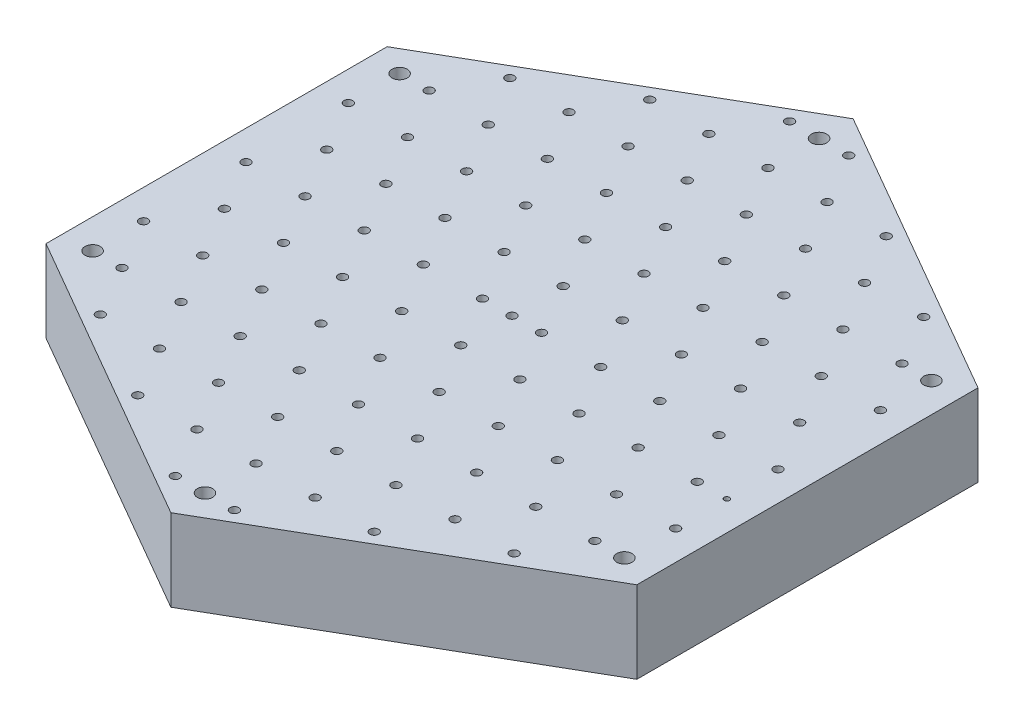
from build123d import *

# Parameters (mm, degrees)
BOSS_EXTRUDE1_DEPTH  = 15
SKETCH4_R            = 1.4
CUT_EXTRUDE3_DEPTH   = 85.029384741
LPATTERN4_COUNT      = 6
LPATTERN4_PITCH      = 10.83
LPATTERN4_COL_COUNT  = 5
LPATTERN4_COL_PITCH  = 10.83
LPATTERN5_COUNT      = 6
LPATTERN5_PITCH      = 10.83
LPATTERN5_COL_COUNT  = 5
LPATTERN5_COL_PITCH  = 10.83
LPATTERN6_COUNT      = 7
LPATTERN6_PITCH      = 10.83
LPATTERN6_COL_COUNT  = 4
LPATTERN6_COL_PITCH  = 10.83
LPATTERN7_COUNT      = 7
LPATTERN7_PITCH      = 10.83
LPATTERN7_COL_COUNT  = 3
LPATTERN7_COL_PITCH  = 10.83
LPATTERN8_COUNT      = 6
LPATTERN8_PITCH      = 10.83
LPATTERN9_COUNT      = 6
LPATTERN9_PITCH      = 10.83
LPATTERN10_COUNT     = 7
LPATTERN10_PITCH     = 10.83
LPATTERN10_COL_COUNT = 3
LPATTERN10_COL_PITCH = 10.83
LPATTERN11_COUNT     = 7
LPATTERN11_PITCH     = 10.83
LPATTERN11_COL_COUNT = 4
LPATTERN11_COL_PITCH = 10.83
LPATTERN12_COUNT     = 5
LPATTERN12_PITCH     = 10.83
LPATTERN12_COL_COUNT = 6
LPATTERN12_COL_PITCH = 10.83
LPATTERN13_COUNT     = 5
LPATTERN13_PITCH     = 10.83
LPATTERN13_COL_COUNT = 6
LPATTERN13_COL_PITCH = 10.83
LPATTERN14_COUNT     = 5
LPATTERN14_PITCH     = 10.83
LPATTERN15_COUNT     = 4
LPATTERN15_PITCH     = 10.83
LPATTERN16_COUNT     = 3
LPATTERN16_PITCH     = 10.83
LPATTERN17_COUNT     = 5
LPATTERN17_PITCH     = 10.83
LPATTERN18_COUNT     = 4
LPATTERN18_PITCH     = 10.83
LPATTERN19_COUNT     = 3
LPATTERN19_PITCH     = 10.83
SKETCH16_R           = 0.5
CUT_EXTRUDE4_DEPTH   = 85.029384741


with BuildPart() as part:
    # Sketch1 → Boss-Extrude1 (new body)
    with BuildSketch(Plane(origin=(0, 0, 0), x_dir=(1, 0, 0), z_dir=(0, 1, 0))):
        Polygon((0, 62.5), (-54.126587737, 31.25), (-54.126587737, -31.25), (0, -62.5), (54.126587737, -31.25), (54.126587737, 31.25), align=None)
    extrude(amount=BOSS_EXTRUDE1_DEPTH)

    # Sketch4 → Cut-Extrude3 (cut, through all)
    with BuildSketch(Plane(origin=(0, 15, 0), x_dir=(1, 0, 0), z_dir=(0, 1, 0))):
        with Locations(Location((0, 56.253070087, 0), (0, 0, 270))):
            Circle(SKETCH4_R)
        with Locations(Location((-48.713928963, 28.125, 0), (0, 0, 270))):
            Circle(SKETCH4_R)
        with Locations(Location((-48.716587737, -28.126535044, 0), (0, 0, 270))):
            Circle(SKETCH4_R)
        with Locations(Location((0, -56.253070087, 0), (0, 0, 270))):
            Circle(SKETCH4_R)
        with Locations(Location((48.716587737, -28.126535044, 0), (0, 0, 270))):
            Circle(SKETCH4_R)
        with Locations(Location((48.716587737, 28.126535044, 0), (0, 0, 270))):
            Circle(SKETCH4_R)
    extrude(amount=-CUT_EXTRUDE3_DEPTH, mode=Mode.SUBTRACT)

    # Sketch5 → Cut-Revolve1 (revolve, cut)
    with BuildSketch(Plane.XY, mode=Mode.PRIVATE) as cut_revolve1_sk:
        Polygon((0, 15), (-0.8, 15), (-0.675, 0), (0, 0), align=None)
    revolve(cut_revolve1_sk.sketch.rotate(Axis((0, -0.75, 0), (0, 1, 0)), 270), axis=Axis((0, -0.75, 0), (0, 1, 0)), mode=Mode.SUBTRACT)

    # Sketch6 → Cut-Revolve2 (revolve, cut)
    with BuildSketch(Plane.XY, mode=Mode.PRIVATE) as cut_revolve2_sk:
        Polygon((5.415, 15), (4.615, 15), (4.74, 0), (5.415, 0), align=None)
    cut_revolve2 = revolve(cut_revolve2_sk.sketch.rotate(Axis((5.415, -0.75, 0), (0, 1, 0)), 270), axis=Axis((5.415, -0.75, 0), (0, 1, 0)), mode=Mode.SUBTRACT)

    # Sketch7 → Cut-Revolve3 (revolve, cut)
    with BuildSketch(Plane.XY, mode=Mode.PRIVATE) as cut_revolve3_sk:
        Polygon((16.245, 15), (15.445, 15), (15.57, 0), (16.245, 0), align=None)
    cut_revolve3 = revolve(cut_revolve3_sk.sketch.rotate(Axis((16.245, -0.75, 0), (0, 1, 0)), 270), axis=Axis((16.245, -0.75, 0), (0, 1, 0)), mode=Mode.SUBTRACT)

    # Sketch8 → Cut-Revolve4 (revolve, cut)
    with BuildSketch(Plane.XY, mode=Mode.PRIVATE) as cut_revolve4_sk:
        Polygon((27.075, 15), (26.275, 15), (26.4, 0), (27.075, 0), align=None)
    cut_revolve4 = revolve(cut_revolve4_sk.sketch.rotate(Axis((27.075, -0.75, 0), (0, 1, 0)), 270), axis=Axis((27.075, -0.75, 0), (0, 1, 0)), mode=Mode.SUBTRACT)

    # Sketch9 → Cut-Revolve5 (revolve, cut)
    with BuildSketch(Plane.XY, mode=Mode.PRIVATE) as cut_revolve5_sk:
        Polygon((37.905, 15), (37.105, 15), (37.23, 0), (37.905, 0), align=None)
    cut_revolve5 = revolve(cut_revolve5_sk.sketch.rotate(Axis((37.905, -0.75, 0), (0, 1, 0)), 270), axis=Axis((37.905, -0.75, 0), (0, 1, 0)), mode=Mode.SUBTRACT)

    # Sketch10 → Cut-Revolve6 (revolve, cut)
    with BuildSketch(Plane.XY, mode=Mode.PRIVATE) as cut_revolve6_sk:
        Polygon((48.735, 15), (47.935, 15), (48.06, 0), (48.735, 0), align=None)
    cut_revolve6 = revolve(cut_revolve6_sk.sketch.rotate(Axis((48.735, -0.75, 0), (0, 1, 0)), 270), axis=Axis((48.735, -0.75, 0), (0, 1, 0)), mode=Mode.SUBTRACT)

    # Sketch11 → Cut-Revolve7 (revolve, cut)
    with BuildSketch(Plane.XY, mode=Mode.PRIVATE) as cut_revolve7_sk:
        Polygon((-48.735, 15), (-49.535, 15), (-49.41, 0), (-48.735, 0), align=None)
    cut_revolve7 = revolve(cut_revolve7_sk.sketch.rotate(Axis((-48.735, -0.75, 0), (0, 1, 0)), 270), axis=Axis((-48.735, -0.75, 0), (0, 1, 0)), mode=Mode.SUBTRACT)

    # Sketch12 → Cut-Revolve8 (revolve, cut)
    with BuildSketch(Plane.XY, mode=Mode.PRIVATE) as cut_revolve8_sk:
        Polygon((-37.905, 15), (-38.705, 15), (-38.58, 0), (-37.905, 0), align=None)
    cut_revolve8 = revolve(cut_revolve8_sk.sketch.rotate(Axis((-37.905, -0.75, 0), (0, 1, 0)), 270), axis=Axis((-37.905, -0.75, 0), (0, 1, 0)), mode=Mode.SUBTRACT)

    # Sketch13 → Cut-Revolve9 (revolve, cut)
    with BuildSketch(Plane.XY, mode=Mode.PRIVATE) as cut_revolve9_sk:
        Polygon((-27.075, 15), (-27.875, 15), (-27.75, 0), (-27.075, 0), align=None)
    cut_revolve9 = revolve(cut_revolve9_sk.sketch.rotate(Axis((-27.075, -0.75, 0), (0, 1, 0)), 270), axis=Axis((-27.075, -0.75, 0), (0, 1, 0)), mode=Mode.SUBTRACT)

    # Sketch14 → Cut-Revolve10 (revolve, cut)
    with BuildSketch(Plane.XY, mode=Mode.PRIVATE) as cut_revolve10_sk:
        Polygon((-16.245, 15), (-17.045, 15), (-16.92, 0), (-16.245, 0), align=None)
    cut_revolve10 = revolve(cut_revolve10_sk.sketch.rotate(Axis((-16.245, -0.75, 0), (0, 1, 0)), 270), axis=Axis((-16.245, -0.75, 0), (0, 1, 0)), mode=Mode.SUBTRACT)

    # Sketch15 → Cut-Revolve11 (revolve, cut)
    with BuildSketch(Plane.XY, mode=Mode.PRIVATE) as cut_revolve11_sk:
        Polygon((-5.415, 15), (-6.215, 15), (-6.09, 0), (-5.415, 0), align=None)
    cut_revolve11 = revolve(cut_revolve11_sk.sketch.rotate(Axis((-5.415, -0.75, 0), (0, 1, 0)), 270), axis=Axis((-5.415, -0.75, 0), (0, 1, 0)), mode=Mode.SUBTRACT)

    # LPattern4: Cut-Revolve2 ×6
    with Locations(*[Vector(-0.49999999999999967, 0, 0.8660254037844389) * (i * LPATTERN4_PITCH) for i in range(1, LPATTERN4_COUNT)]):
        add(cut_revolve2, mode=Mode.SUBTRACT)

    # LPattern4 col: Cut-Revolve2 ×5
    with Locations(*[Vector(0.49999999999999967, 0, -0.8660254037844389) * (i * LPATTERN4_COL_PITCH) for i in range(1, LPATTERN4_COL_COUNT)]):
        add(cut_revolve2, mode=Mode.SUBTRACT)

    # LPattern5: Cut-Revolve3 ×6
    with Locations(*[Vector(-0.49999999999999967, 0, 0.8660254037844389) * (i * LPATTERN5_PITCH) for i in range(1, LPATTERN5_COUNT)]):
        add(cut_revolve3, mode=Mode.SUBTRACT)

    # LPattern5 col: Cut-Revolve3 ×5
    with Locations(*[Vector(0.49999999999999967, 0, -0.8660254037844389) * (i * LPATTERN5_COL_PITCH) for i in range(1, LPATTERN5_COL_COUNT)]):
        add(cut_revolve3, mode=Mode.SUBTRACT)

    # LPattern6: Cut-Revolve4 ×7
    with Locations(*[Vector(-0.49999999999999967, 0, 0.8660254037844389) * (i * LPATTERN6_PITCH) for i in range(1, LPATTERN6_COUNT)]):
        add(cut_revolve4, mode=Mode.SUBTRACT)

    # LPattern6 col: Cut-Revolve4 ×4
    with Locations(*[Vector(0.49999999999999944, 0, -0.866025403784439) * (i * LPATTERN6_COL_PITCH) for i in range(1, LPATTERN6_COL_COUNT)]):
        add(cut_revolve4, mode=Mode.SUBTRACT)

    # LPattern7: Cut-Revolve5 ×7
    with Locations(*[Vector(-0.49999999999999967, 0, 0.8660254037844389) * (i * LPATTERN7_PITCH) for i in range(1, LPATTERN7_COUNT)]):
        add(cut_revolve5, mode=Mode.SUBTRACT)

    # LPattern7 col: Cut-Revolve5 ×3
    with Locations(*[Vector(0.49999999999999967, 0, -0.8660254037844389) * (i * LPATTERN7_COL_PITCH) for i in range(1, LPATTERN7_COL_COUNT)]):
        add(cut_revolve5, mode=Mode.SUBTRACT)

    # LPattern8: Cut-Revolve6 ×6
    with Locations(*[Vector(-0.49999999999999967, 0, 0.8660254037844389) * (i * LPATTERN8_PITCH) for i in range(1, LPATTERN8_COUNT)]):
        add(cut_revolve6, mode=Mode.SUBTRACT)

    # LPattern9: Cut-Revolve7 ×6
    with Locations(*[Vector(0.49999999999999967, 0, -0.8660254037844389) * (i * LPATTERN9_PITCH) for i in range(1, LPATTERN9_COUNT)]):
        add(cut_revolve7, mode=Mode.SUBTRACT)

    # LPattern10: Cut-Revolve8 ×7
    with Locations(*[Vector(0.49999999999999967, 0, -0.8660254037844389) * (i * LPATTERN10_PITCH) for i in range(1, LPATTERN10_COUNT)]):
        add(cut_revolve8, mode=Mode.SUBTRACT)

    # LPattern10 col: Cut-Revolve8 ×3
    with Locations(*[Vector(-0.49999999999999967, 0, 0.8660254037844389) * (i * LPATTERN10_COL_PITCH) for i in range(1, LPATTERN10_COL_COUNT)]):
        add(cut_revolve8, mode=Mode.SUBTRACT)

    # LPattern11: Cut-Revolve9 ×7
    with Locations(*[Vector(0.49999999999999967, 0, -0.8660254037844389) * (i * LPATTERN11_PITCH) for i in range(1, LPATTERN11_COUNT)]):
        add(cut_revolve9, mode=Mode.SUBTRACT)

    # LPattern11 col: Cut-Revolve9 ×4
    with Locations(*[Vector(-0.49999999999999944, 0, 0.866025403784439) * (i * LPATTERN11_COL_PITCH) for i in range(1, LPATTERN11_COL_COUNT)]):
        add(cut_revolve9, mode=Mode.SUBTRACT)

    # LPattern12: Cut-Revolve10 ×5
    with Locations(*[Vector(-0.49999999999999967, 0, 0.8660254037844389) * (i * LPATTERN12_PITCH) for i in range(1, LPATTERN12_COUNT)]):
        add(cut_revolve10, mode=Mode.SUBTRACT)

    # LPattern12 col: Cut-Revolve10 ×6
    with Locations(*[Vector(0.49999999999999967, 0, -0.8660254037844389) * (i * LPATTERN12_COL_PITCH) for i in range(1, LPATTERN12_COL_COUNT)]):
        add(cut_revolve10, mode=Mode.SUBTRACT)

    # LPattern13: Cut-Revolve11 ×5
    with Locations(*[Vector(-0.49999999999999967, 0, 0.8660254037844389) * (i * LPATTERN13_PITCH) for i in range(1, LPATTERN13_COUNT)]):
        add(cut_revolve11, mode=Mode.SUBTRACT)

    # LPattern13 col: Cut-Revolve11 ×6
    with Locations(*[Vector(0.49999999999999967, 0, -0.8660254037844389) * (i * LPATTERN13_COL_PITCH) for i in range(1, LPATTERN13_COL_COUNT)]):
        add(cut_revolve11, mode=Mode.SUBTRACT)

    # LPattern14: Cut-Revolve3 ×5
    with Locations(*[Vector(0.49999999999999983, 0, 0.8660254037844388) * (i * LPATTERN14_PITCH) for i in range(1, LPATTERN14_COUNT)]):
        add(cut_revolve3, mode=Mode.SUBTRACT)

    # LPattern15: Cut-Revolve4 ×4
    with Locations(*[Vector(0.4999999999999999, 0, 0.8660254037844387) * (i * LPATTERN15_PITCH) for i in range(1, LPATTERN15_COUNT)]):
        add(cut_revolve4, mode=Mode.SUBTRACT)

    # LPattern16: Cut-Revolve5 ×3
    with Locations(*[Vector(0.49999999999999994, 0, 0.8660254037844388) * (i * LPATTERN16_PITCH) for i in range(1, LPATTERN16_COUNT)]):
        add(cut_revolve5, mode=Mode.SUBTRACT)

    # LPattern17: Cut-Revolve10 ×5
    with Locations(*[Vector(-0.4999999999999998, 0, -0.8660254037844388) * (i * LPATTERN17_PITCH) for i in range(1, LPATTERN17_COUNT)]):
        add(cut_revolve10, mode=Mode.SUBTRACT)

    # LPattern18: Cut-Revolve9 ×4
    with Locations(*[Vector(-0.49999999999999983, 0, -0.8660254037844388) * (i * LPATTERN18_PITCH) for i in range(1, LPATTERN18_COUNT)]):
        add(cut_revolve9, mode=Mode.SUBTRACT)

    # LPattern19: Cut-Revolve8 ×3
    with Locations(*[Vector(-0.49999999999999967, 0, -0.8660254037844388) * (i * LPATTERN19_PITCH) for i in range(1, LPATTERN19_COUNT)]):
        add(cut_revolve8, mode=Mode.SUBTRACT)

    # Sketch16 → Cut-Extrude4 (cut, through all)
    with BuildSketch(Plane(origin=(0, 15, 0), x_dir=(1, 0, 0), z_dir=(0, 1, 0))):
        with Locations(Location((48.735, -9.379055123, 0), (0, 0, 270))):
            Circle(SKETCH16_R)
    extrude(amount=-CUT_EXTRUDE4_DEPTH, mode=Mode.SUBTRACT)


solid = part.part
